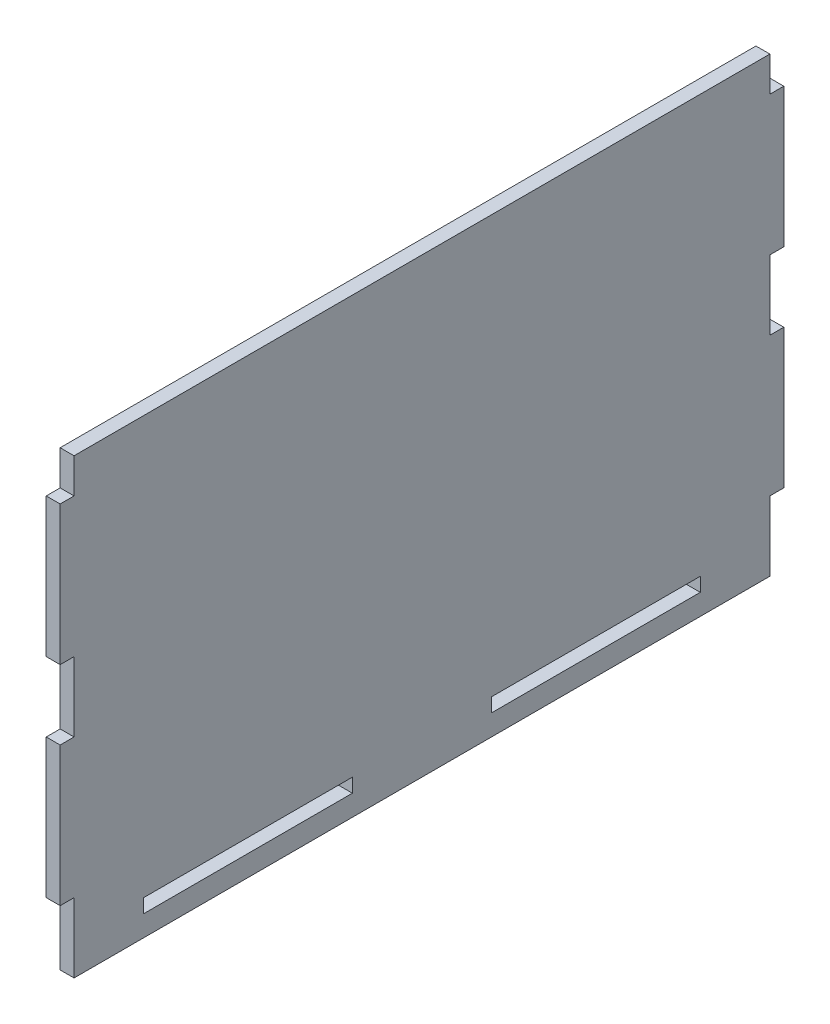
from build123d import *

# Parameters (mm, degrees)
CROQUIS1_W              = 300
CROQUIS1_H              = 20
SALIENTE_EXTRUIR1_DEPTH = 20


with BuildPart() as part:
    # Croquis1 → Saliente-Extruir1 (new body)
    with BuildSketch(Plane(origin=(0, 0, 0), x_dir=(0, 0, -1), z_dir=(1, 0, 0))):
        Polygon((0, 0), (1000, 0), (1000, 100), (1020, 100), (1020, 300), (1000, 300), (1000, 400), (1020, 400), (1020, 600), (1000, 600), (1000, 650), (0, 650), (0, 600), (-20, 600), (-20, 400), (0, 400), (0, 300), (-20, 300), (-20, 100), (0, 100), align=None)
        with Locations((250, 40)):
            Rectangle(CROQUIS1_W, CROQUIS1_H, mode=Mode.SUBTRACT)
        with Locations((750, 40)):
            Rectangle(CROQUIS1_W, CROQUIS1_H, mode=Mode.SUBTRACT)
    extrude(amount=SALIENTE_EXTRUIR1_DEPTH)


solid = part.part
